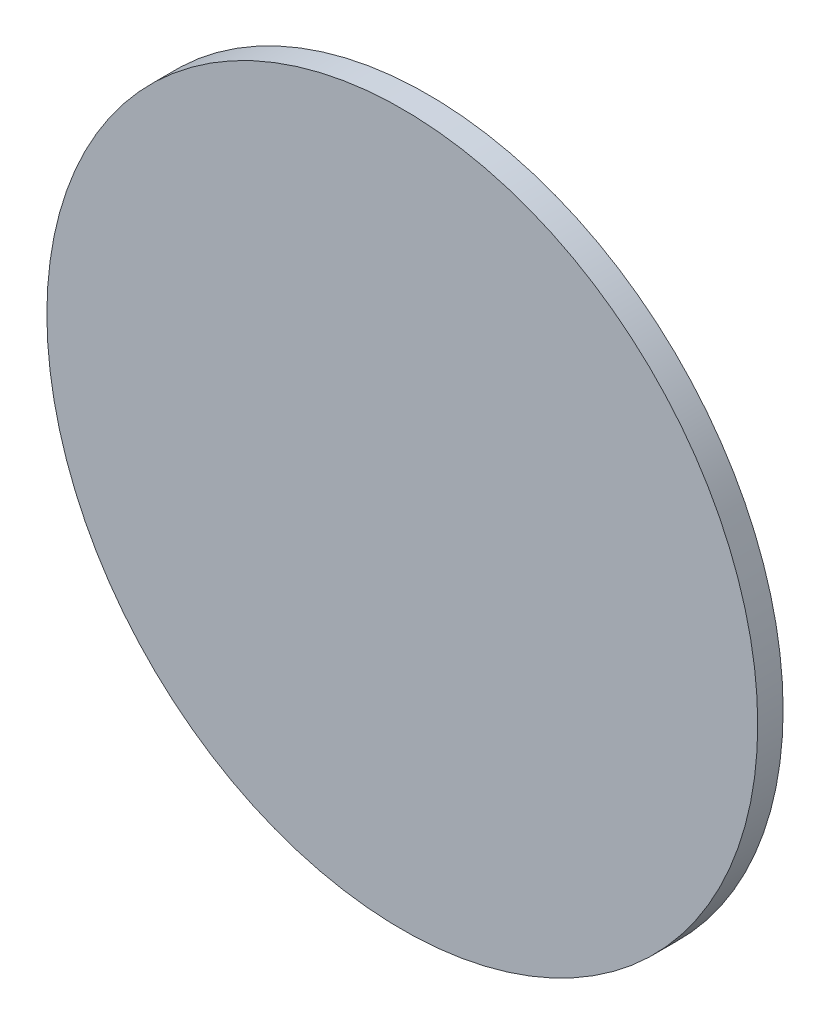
from build123d import *

# Parameters (mm, degrees)
CROQUIS1_R              = 14
SALIENTE_EXTRUIR1_DEPTH = 1


with BuildPart() as part:
    # Croquis1 → Saliente-Extruir1 (new body)
    with BuildSketch(Plane.XY):
        Circle(CROQUIS1_R)
    extrude(amount=SALIENTE_EXTRUIR1_DEPTH)


solid = part.part
